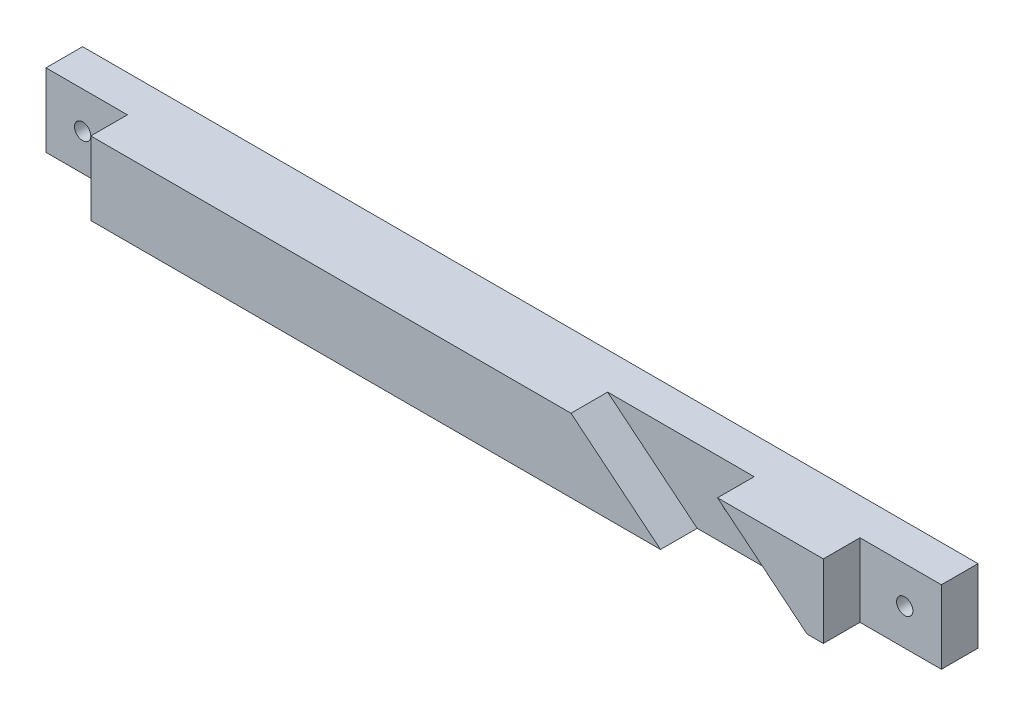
from build123d import *

# Parameters (mm, degrees)
ESQUISSE1_W             = 110
ESQUISSE1_H             = 9
EXTRUSION1_DEPTH        = 9
ESQUISSE2_W             = 10
ESQUISSE2_H             = 9
ENL_V_MAT_EXTRU_1_DEPTH = 4.5
ESQUISSE4_R             = 1
ENL_V_MAT_EXTRU_2_DEPTH = 4.5
ESQUISSE5_R             = 1
ENL_V_MAT_EXTRU_3_DEPTH = 4.5
ENL_V_MAT_EXTRU_4_DEPTH = 4.5
ESQUISSE8_R             = 1
ENL_V_MAT_EXTRU_5_DEPTH = 4.5


with BuildPart() as part:
    # Esquisse1 → Extrusion1 (new body)
    with BuildSketch(Plane.XY):
        with Locations((-12.271684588, -105.117562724)):
            Rectangle(ESQUISSE1_W, ESQUISSE1_H)
    extrude(amount=EXTRUSION1_DEPTH)

    # Esquisse2 → Enl_v. mat.-Extru.1 (cut)
    with BuildSketch(Plane.XY.offset(9)):
        with Locations((-62.271684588, -105.117562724)):
            Rectangle(ESQUISSE2_W, ESQUISSE2_H)
        with Locations((37.728315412, -105.117562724)):
            Rectangle(ESQUISSE2_W, ESQUISSE2_H)
    extrude(amount=-ENL_V_MAT_EXTRU_1_DEPTH, mode=Mode.SUBTRACT)

    # Esquisse4 → Enl_v. mat.-Extru.2 (cut)
    with BuildSketch(Plane.XY.offset(4.5)):
        with Locations((38.22840174, -105.145436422)):
            Circle(ESQUISSE4_R)
    extrude(amount=-ENL_V_MAT_EXTRU_2_DEPTH, mode=Mode.SUBTRACT)

    # Esquisse5 → Enl_v. mat.-Extru.3 (cut)
    with BuildSketch(Plane.XY.offset(4.5)):
        with Locations((-62.771684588, -105.117562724)):
            Circle(ESQUISSE5_R)
    extrude(amount=-ENL_V_MAT_EXTRU_3_DEPTH, mode=Mode.SUBTRACT)

    # Esquisse6 → Enl_v. mat.-Extru.4 (cut)
    with BuildSketch(Plane.XY.offset(9)):
        Polygon((30.728315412, -109.617562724), (19.728315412, -100.617562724), (1.728315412, -100.617562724), (12.728315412, -109.617562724), align=None)
    extrude(amount=-ENL_V_MAT_EXTRU_4_DEPTH, mode=Mode.SUBTRACT)

    # Esquisse8 → Enl_v. mat.-Extru.5 (cut)
    with BuildSketch(Plane.XY.offset(4.5)):
        with Locations((16.728315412, -105.117562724)):
            Circle(ESQUISSE8_R)
    extrude(amount=-ENL_V_MAT_EXTRU_5_DEPTH, mode=Mode.SUBTRACT)


solid = part.part
